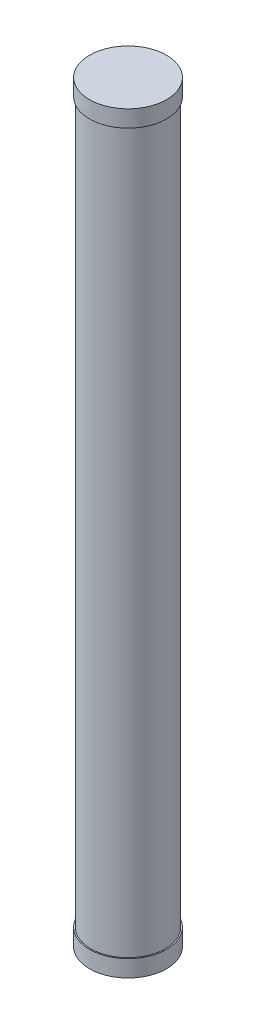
ISO-10303-21;
HEADER;
FILE_DESCRIPTION(('STEP AP214'),'2;1');
FILE_NAME('part.step','',(''),(''),'','','');
FILE_SCHEMA(('AUTOMOTIVE_DESIGN { 1 0 10303 214 1 1 1 1 }'));
ENDSEC;
DATA;
#1=APPLICATION_CONTEXT('core data for automotive mechanical design processes');
#2=APPLICATION_PROTOCOL_DEFINITION('international standard','automotive_design',2000,#1);
#3=PRODUCT_CONTEXT('',#1,'mechanical');
#4=PRODUCT('Part','Part','',(#3));
#5=PRODUCT_RELATED_PRODUCT_CATEGORY('part','',(#4));
#6=PRODUCT_DEFINITION_FORMATION('','',#4);
#7=PRODUCT_DEFINITION_CONTEXT('part definition',#1,'design');
#8=PRODUCT_DEFINITION('design','',#6,#7);
#9=PRODUCT_DEFINITION_SHAPE('','',#8);
#10=(LENGTH_UNIT() NAMED_UNIT(*) SI_UNIT(.MILLI.,.METRE.));
#11=(NAMED_UNIT(*) PLANE_ANGLE_UNIT() SI_UNIT($,.RADIAN.));
#12=(NAMED_UNIT(*) SI_UNIT($,.STERADIAN.) SOLID_ANGLE_UNIT());
#13=UNCERTAINTY_MEASURE_WITH_UNIT(LENGTH_MEASURE(1.E-05),#10,'distance_accuracy_value','');
#14=(GEOMETRIC_REPRESENTATION_CONTEXT(3) GLOBAL_UNCERTAINTY_ASSIGNED_CONTEXT((#13)) GLOBAL_UNIT_ASSIGNED_CONTEXT((#10,
#11,#12)) REPRESENTATION_CONTEXT('',''));
#15=CARTESIAN_POINT('',(0.,0.,0.));
#16=DIRECTION('',(0.,0.,1.));
#17=DIRECTION('',(1.,0.,0.));
#18=AXIS2_PLACEMENT_3D('',#15,#16,#17);
#19=CARTESIAN_POINT('',(0.,-303.,0.));
#20=DIRECTION('',(0.,1.,0.));
#21=DIRECTION('',(0.,0.,-1.));
#22=AXIS2_PLACEMENT_3D('',#19,#20,#21);
#23=CYLINDRICAL_SURFACE('',#22,31.);
#24=CARTESIAN_POINT('',(0.,-303.,0.));
#25=DIRECTION('',(0.,1.,0.));
#26=DIRECTION('',(0.,0.,1.));
#27=AXIS2_PLACEMENT_3D('',#24,#25,#26);
#28=CIRCLE('',#27,31.);
#29=CARTESIAN_POINT('',(0.,-303.,31.));
#30=VERTEX_POINT('',#29);
#31=EDGE_CURVE('E11',#30,#30,#28,.T.);
#32=ORIENTED_EDGE('',*,*,#31,.T.);
#33=EDGE_LOOP('',(#32));
#34=FACE_BOUND('',#33,.T.);
#35=CARTESIAN_POINT('',(0.,-289.5,0.));
#36=DIRECTION('',(0.,-1.,0.));
#37=DIRECTION('',(0.,0.,-1.));
#38=AXIS2_PLACEMENT_3D('',#35,#36,#37);
#39=CIRCLE('',#38,31.);
#40=CARTESIAN_POINT('',(0.,-289.5,-31.));
#41=VERTEX_POINT('',#40);
#42=EDGE_CURVE('E46',#41,#41,#39,.T.);
#43=ORIENTED_EDGE('',*,*,#42,.T.);
#44=EDGE_LOOP('',(#43));
#45=FACE_BOUND('',#44,.T.);
#46=ADVANCED_FACE('F40',(#34,#45),#23,.T.);
#47=CARTESIAN_POINT('',(0.,-303.,0.));
#48=DIRECTION('',(0.,-1.,0.));
#49=DIRECTION('',(0.,0.,1.));
#50=AXIS2_PLACEMENT_3D('',#47,#48,#49);
#51=PLANE('',#50);
#52=ORIENTED_EDGE('',*,*,#31,.F.);
#53=EDGE_LOOP('',(#52));
#54=FACE_BOUND('',#53,.T.);
#55=ADVANCED_FACE('F72',(#54),#51,.T.);
#56=CARTESIAN_POINT('',(0.,-289.5,0.));
#57=DIRECTION('',(0.,1.,0.));
#58=DIRECTION('',(0.,0.,-1.));
#59=AXIS2_PLACEMENT_3D('',#56,#57,#58);
#60=PLANE('',#59);
#61=ORIENTED_EDGE('',*,*,#42,.F.);
#62=EDGE_LOOP('',(#61));
#63=FACE_BOUND('',#62,.T.);
#64=CARTESIAN_POINT('',(0.,-289.5,0.));
#65=DIRECTION('',(0.,-1.,0.));
#66=DIRECTION('',(0.,0.,-1.));
#67=AXIS2_PLACEMENT_3D('',#64,#65,#66);
#68=CIRCLE('',#67,30.);
#69=CARTESIAN_POINT('',(0.,-289.5,-30.));
#70=VERTEX_POINT('',#69);
#71=EDGE_CURVE('E50',#70,#70,#68,.T.);
#72=ORIENTED_EDGE('',*,*,#71,.T.);
#73=EDGE_LOOP('',(#72));
#74=FACE_BOUND('',#73,.T.);
#75=ADVANCED_FACE('F67',(#63,#74),#60,.T.);
#76=CARTESIAN_POINT('',(0.,-289.5,0.));
#77=DIRECTION('',(0.,-1.,0.));
#78=DIRECTION('',(0.,0.,1.));
#79=AXIS2_PLACEMENT_3D('',#76,#77,#78);
#80=CYLINDRICAL_SURFACE('',#79,30.);
#81=ORIENTED_EDGE('',*,*,#71,.F.);
#82=EDGE_LOOP('',(#81));
#83=FACE_BOUND('',#82,.T.);
#84=CARTESIAN_POINT('',(0.,-301.5,0.));
#85=DIRECTION('',(0.,-1.,0.));
#86=DIRECTION('',(0.,0.,-1.));
#87=AXIS2_PLACEMENT_3D('',#84,#85,#86);
#88=CIRCLE('',#87,30.);
#89=CARTESIAN_POINT('',(0.,-301.5,-30.));
#90=VERTEX_POINT('',#89);
#91=EDGE_CURVE('E54',#90,#90,#88,.T.);
#92=ORIENTED_EDGE('',*,*,#91,.T.);
#93=EDGE_LOOP('',(#92));
#94=FACE_BOUND('',#93,.T.);
#95=ADVANCED_FACE('F60',(#83,#94),#80,.F.);
#96=CARTESIAN_POINT('',(0.,-301.5,0.));
#97=DIRECTION('',(0.,-1.,0.));
#98=DIRECTION('',(0.,0.,1.));
#99=AXIS2_PLACEMENT_3D('',#96,#97,#98);
#100=PLANE('',#99);
#101=ORIENTED_EDGE('',*,*,#91,.F.);
#102=EDGE_LOOP('',(#101));
#103=FACE_BOUND('',#102,.T.);
#104=ADVANCED_FACE('F62',(#103),#100,.F.);
#105=CLOSED_SHELL('',(#46,#55,#75,#95,#104));
#106=MANIFOLD_SOLID_BREP('B2',#105);
#107=CARTESIAN_POINT('',(0.,303.,0.));
#108=DIRECTION('',(0.,-1.,0.));
#109=DIRECTION('',(0.,0.,-1.));
#110=AXIS2_PLACEMENT_3D('',#107,#108,#109);
#111=CYLINDRICAL_SURFACE('',#110,31.);
#112=CARTESIAN_POINT('',(0.,303.,0.));
#113=DIRECTION('',(0.,1.,0.));
#114=DIRECTION('',(0.,0.,1.));
#115=AXIS2_PLACEMENT_3D('',#112,#113,#114);
#116=CIRCLE('',#115,31.);
#117=CARTESIAN_POINT('',(0.,303.,31.));
#118=VERTEX_POINT('',#117);
#119=EDGE_CURVE('E39',#118,#118,#116,.T.);
#120=ORIENTED_EDGE('',*,*,#119,.F.);
#121=EDGE_LOOP('',(#120));
#122=FACE_BOUND('',#121,.T.);
#123=CARTESIAN_POINT('',(0.,289.5,0.));
#124=DIRECTION('',(0.,-1.,0.));
#125=DIRECTION('',(0.,0.,-1.));
#126=AXIS2_PLACEMENT_3D('',#123,#124,#125);
#127=CIRCLE('',#126,31.);
#128=CARTESIAN_POINT('',(0.,289.5,-31.));
#129=VERTEX_POINT('',#128);
#130=EDGE_CURVE('E127',#129,#129,#127,.T.);
#131=ORIENTED_EDGE('',*,*,#130,.F.);
#132=EDGE_LOOP('',(#131));
#133=FACE_BOUND('',#132,.T.);
#134=ADVANCED_FACE('F121',(#122,#133),#111,.T.);
#135=CARTESIAN_POINT('',(0.,303.,0.));
#136=DIRECTION('',(0.,1.,0.));
#137=DIRECTION('',(0.,0.,1.));
#138=AXIS2_PLACEMENT_3D('',#135,#136,#137);
#139=PLANE('',#138);
#140=ORIENTED_EDGE('',*,*,#119,.T.);
#141=EDGE_LOOP('',(#140));
#142=FACE_BOUND('',#141,.T.);
#143=ADVANCED_FACE('F152',(#142),#139,.T.);
#144=CARTESIAN_POINT('',(0.,289.5,0.));
#145=DIRECTION('',(0.,-1.,0.));
#146=DIRECTION('',(0.,0.,-1.));
#147=AXIS2_PLACEMENT_3D('',#144,#145,#146);
#148=PLANE('',#147);
#149=ORIENTED_EDGE('',*,*,#130,.T.);
#150=EDGE_LOOP('',(#149));
#151=FACE_BOUND('',#150,.T.);
#152=CARTESIAN_POINT('',(0.,289.5,0.));
#153=DIRECTION('',(0.,-1.,0.));
#154=DIRECTION('',(0.,0.,-1.));
#155=AXIS2_PLACEMENT_3D('',#152,#153,#154);
#156=CIRCLE('',#155,30.);
#157=CARTESIAN_POINT('',(0.,289.5,-30.));
#158=VERTEX_POINT('',#157);
#159=EDGE_CURVE('E131',#158,#158,#156,.T.);
#160=ORIENTED_EDGE('',*,*,#159,.F.);
#161=EDGE_LOOP('',(#160));
#162=FACE_BOUND('',#161,.T.);
#163=ADVANCED_FACE('F145',(#151,#162),#148,.T.);
#164=CARTESIAN_POINT('',(0.,289.5,0.));
#165=DIRECTION('',(0.,1.,0.));
#166=DIRECTION('',(0.,0.,1.));
#167=AXIS2_PLACEMENT_3D('',#164,#165,#166);
#168=CYLINDRICAL_SURFACE('',#167,30.);
#169=ORIENTED_EDGE('',*,*,#159,.T.);
#170=EDGE_LOOP('',(#169));
#171=FACE_BOUND('',#170,.T.);
#172=CARTESIAN_POINT('',(0.,301.5,0.));
#173=DIRECTION('',(0.,-1.,0.));
#174=DIRECTION('',(0.,0.,-1.));
#175=AXIS2_PLACEMENT_3D('',#172,#173,#174);
#176=CIRCLE('',#175,30.);
#177=CARTESIAN_POINT('',(0.,301.5,-30.));
#178=VERTEX_POINT('',#177);
#179=EDGE_CURVE('E135',#178,#178,#176,.T.);
#180=ORIENTED_EDGE('',*,*,#179,.F.);
#181=EDGE_LOOP('',(#180));
#182=FACE_BOUND('',#181,.T.);
#183=ADVANCED_FACE('F143',(#171,#182),#168,.F.);
#184=CARTESIAN_POINT('',(0.,301.5,0.));
#185=DIRECTION('',(0.,1.,0.));
#186=DIRECTION('',(0.,0.,1.));
#187=AXIS2_PLACEMENT_3D('',#184,#185,#186);
#188=PLANE('',#187);
#189=ORIENTED_EDGE('',*,*,#179,.T.);
#190=EDGE_LOOP('',(#189));
#191=FACE_BOUND('',#190,.T.);
#192=ADVANCED_FACE('F141',(#191),#188,.F.);
#193=CLOSED_SHELL('',(#134,#143,#163,#183,#192));
#194=MANIFOLD_SOLID_BREP('B6',#193);
#195=CARTESIAN_POINT('',(0.,301.5,0.));
#196=DIRECTION('',(0.,-1.,0.));
#197=DIRECTION('',(0.,0.,-1.));
#198=AXIS2_PLACEMENT_3D('',#195,#196,#197);
#199=CYLINDRICAL_SURFACE('',#198,30.);
#200=CARTESIAN_POINT('',(0.,301.5,0.));
#201=DIRECTION('',(0.,1.,0.));
#202=DIRECTION('',(0.,0.,1.));
#203=AXIS2_PLACEMENT_3D('',#200,#201,#202);
#204=CIRCLE('',#203,30.);
#205=CARTESIAN_POINT('',(0.,301.5,30.));
#206=VERTEX_POINT('',#205);
#207=EDGE_CURVE('E120',#206,#206,#204,.T.);
#208=ORIENTED_EDGE('',*,*,#207,.F.);
#209=EDGE_LOOP('',(#208));
#210=FACE_BOUND('',#209,.T.);
#211=CARTESIAN_POINT('',(0.,-301.5,0.));
#212=DIRECTION('',(0.,1.,0.));
#213=DIRECTION('',(0.,0.,1.));
#214=AXIS2_PLACEMENT_3D('',#211,#212,#213);
#215=CIRCLE('',#214,30.);
#216=CARTESIAN_POINT('',(0.,-301.5,30.));
#217=VERTEX_POINT('',#216);
#218=EDGE_CURVE('E198',#217,#217,#215,.T.);
#219=ORIENTED_EDGE('',*,*,#218,.T.);
#220=EDGE_LOOP('',(#219));
#221=FACE_BOUND('',#220,.T.);
#222=ADVANCED_FACE('F195',(#210,#221),#199,.T.);
#223=CARTESIAN_POINT('',(0.,301.5,0.));
#224=DIRECTION('',(0.,1.,0.));
#225=DIRECTION('',(0.,0.,1.));
#226=AXIS2_PLACEMENT_3D('',#223,#224,#225);
#227=PLANE('',#226);
#228=ORIENTED_EDGE('',*,*,#207,.T.);
#229=EDGE_LOOP('',(#228));
#230=FACE_BOUND('',#229,.T.);
#231=ADVANCED_FACE('F210',(#230),#227,.T.);
#232=CARTESIAN_POINT('',(0.,-301.5,0.));
#233=DIRECTION('',(0.,1.,0.));
#234=DIRECTION('',(0.,0.,1.));
#235=AXIS2_PLACEMENT_3D('',#232,#233,#234);
#236=PLANE('',#235);
#237=ORIENTED_EDGE('',*,*,#218,.F.);
#238=EDGE_LOOP('',(#237));
#239=FACE_BOUND('',#238,.T.);
#240=ADVANCED_FACE('F208',(#239),#236,.F.);
#241=CLOSED_SHELL('',(#222,#231,#240));
#242=MANIFOLD_SOLID_BREP('B34',#241);
#243=ADVANCED_BREP_SHAPE_REPRESENTATION('',(#18,#106,#194,#242),#14);
#244=SHAPE_DEFINITION_REPRESENTATION(#9,#243);
ENDSEC;
END-ISO-10303-21;
